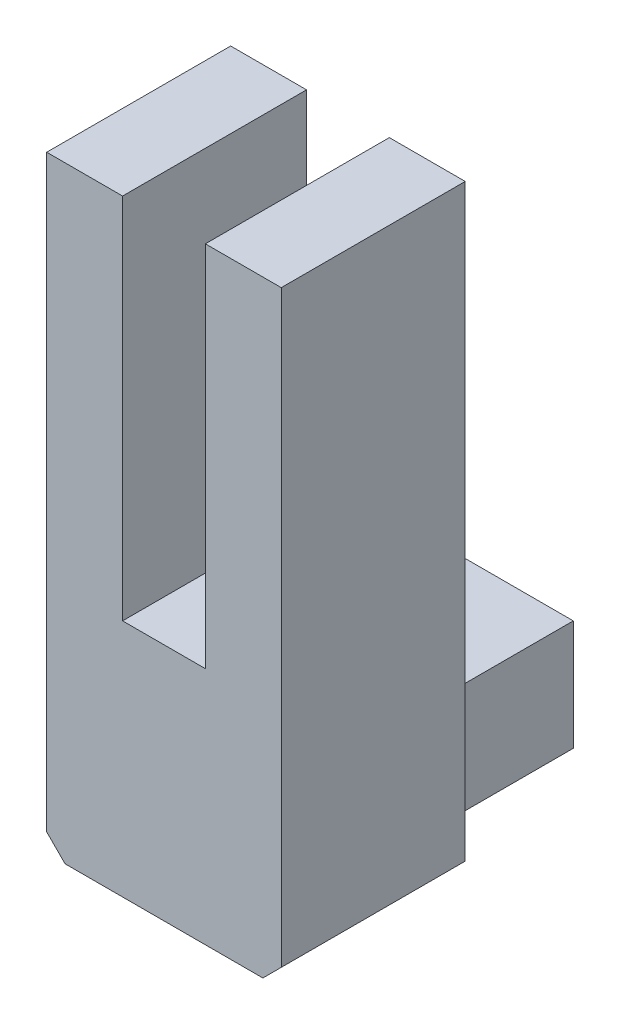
ISO-10303-21;
HEADER;
FILE_DESCRIPTION(('STEP AP214'),'2;1');
FILE_NAME('part.step','',(''),(''),'','','');
FILE_SCHEMA(('AUTOMOTIVE_DESIGN { 1 0 10303 214 1 1 1 1 }'));
ENDSEC;
DATA;
#1=APPLICATION_CONTEXT('core data for automotive mechanical design processes');
#2=APPLICATION_PROTOCOL_DEFINITION('international standard','automotive_design',2000,#1);
#3=PRODUCT_CONTEXT('',#1,'mechanical');
#4=PRODUCT('Part','Part','',(#3));
#5=PRODUCT_RELATED_PRODUCT_CATEGORY('part','',(#4));
#6=PRODUCT_DEFINITION_FORMATION('','',#4);
#7=PRODUCT_DEFINITION_CONTEXT('part definition',#1,'design');
#8=PRODUCT_DEFINITION('design','',#6,#7);
#9=PRODUCT_DEFINITION_SHAPE('','',#8);
#10=(LENGTH_UNIT() NAMED_UNIT(*) SI_UNIT(.MILLI.,.METRE.));
#11=(NAMED_UNIT(*) PLANE_ANGLE_UNIT() SI_UNIT($,.RADIAN.));
#12=(NAMED_UNIT(*) SI_UNIT($,.STERADIAN.) SOLID_ANGLE_UNIT());
#13=UNCERTAINTY_MEASURE_WITH_UNIT(LENGTH_MEASURE(1.E-05),#10,'distance_accuracy_value','');
#14=(GEOMETRIC_REPRESENTATION_CONTEXT(3) GLOBAL_UNCERTAINTY_ASSIGNED_CONTEXT((#13)) GLOBAL_UNIT_ASSIGNED_CONTEXT((#10,
#11,#12)) REPRESENTATION_CONTEXT('',''));
#15=CARTESIAN_POINT('',(0.,0.,0.));
#16=DIRECTION('',(0.,0.,1.));
#17=DIRECTION('',(1.,0.,0.));
#18=AXIS2_PLACEMENT_3D('',#15,#16,#17);
#19=CARTESIAN_POINT('',(-4.49999999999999,40.,0.));
#20=DIRECTION('',(0.,0.,1.));
#21=DIRECTION('',(1.,0.,0.));
#22=AXIS2_PLACEMENT_3D('',#19,#20,#21);
#23=PLANE('',#22);
#24=DIRECTION('',(0.,-1.,0.));
#25=VECTOR('',#24,1.);
#26=CARTESIAN_POINT('',(6.,-26.,0.));
#27=LINE('',#26,#25);
#28=CARTESIAN_POINT('',(6.,-14.,0.));
#29=VERTEX_POINT('',#28);
#30=CARTESIAN_POINT('',(6.,-26.,0.));
#31=VERTEX_POINT('',#30);
#32=EDGE_CURVE('E37',#29,#31,#27,.T.);
#33=ORIENTED_EDGE('',*,*,#32,.F.);
#34=DIRECTION('',(1.,0.,0.));
#35=VECTOR('',#34,1.);
#36=CARTESIAN_POINT('',(6.,-14.,0.));
#37=LINE('',#36,#35);
#38=CARTESIAN_POINT('',(-6.,-14.,0.));
#39=VERTEX_POINT('',#38);
#40=EDGE_CURVE('E154',#39,#29,#37,.T.);
#41=ORIENTED_EDGE('',*,*,#40,.F.);
#42=DIRECTION('',(0.,1.,0.));
#43=VECTOR('',#42,1.);
#44=CARTESIAN_POINT('',(-6.,-26.,0.));
#45=LINE('',#44,#43);
#46=CARTESIAN_POINT('',(-6.,-26.,0.));
#47=VERTEX_POINT('',#46);
#48=EDGE_CURVE('E170',#47,#39,#45,.T.);
#49=ORIENTED_EDGE('',*,*,#48,.F.);
#50=DIRECTION('',(1.,0.,0.));
#51=VECTOR('',#50,1.);
#52=CARTESIAN_POINT('',(-10.75,-26.,0.));
#53=LINE('',#52,#51);
#54=CARTESIAN_POINT('',(-10.75,-26.,0.));
#55=VERTEX_POINT('',#54);
#56=EDGE_CURVE('E175',#55,#47,#53,.T.);
#57=ORIENTED_EDGE('',*,*,#56,.F.);
#58=DIRECTION('',(0.707106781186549,-0.707106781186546,0.));
#59=VECTOR('',#58,1.);
#60=CARTESIAN_POINT('',(-12.75,-24.,0.));
#61=LINE('',#60,#59);
#62=CARTESIAN_POINT('',(-12.75,-24.,0.));
#63=VERTEX_POINT('',#62);
#64=EDGE_CURVE('E176',#63,#55,#61,.T.);
#65=ORIENTED_EDGE('',*,*,#64,.F.);
#66=DIRECTION('',(0.,-1.,0.));
#67=VECTOR('',#66,1.);
#68=CARTESIAN_POINT('',(-12.75,40.,0.));
#69=LINE('',#68,#67);
#70=CARTESIAN_POINT('',(-12.75,40.,0.));
#71=VERTEX_POINT('',#70);
#72=EDGE_CURVE('E225',#71,#63,#69,.T.);
#73=ORIENTED_EDGE('',*,*,#72,.F.);
#74=DIRECTION('',(-1.,0.,0.));
#75=VECTOR('',#74,1.);
#76=CARTESIAN_POINT('',(-4.49999999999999,40.,0.));
#77=LINE('',#76,#75);
#78=CARTESIAN_POINT('',(-4.49999999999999,40.,0.));
#79=VERTEX_POINT('',#78);
#80=EDGE_CURVE('E160',#79,#71,#77,.T.);
#81=ORIENTED_EDGE('',*,*,#80,.F.);
#82=DIRECTION('',(0.,1.,0.));
#83=VECTOR('',#82,1.);
#84=CARTESIAN_POINT('',(-4.49999999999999,0.,0.));
#85=LINE('',#84,#83);
#86=CARTESIAN_POINT('',(-4.49999999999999,0.,0.));
#87=VERTEX_POINT('',#86);
#88=EDGE_CURVE('E157',#87,#79,#85,.T.);
#89=ORIENTED_EDGE('',*,*,#88,.F.);
#90=DIRECTION('',(-1.,0.,0.));
#91=VECTOR('',#90,1.);
#92=CARTESIAN_POINT('',(4.5,0.,0.));
#93=LINE('',#92,#91);
#94=CARTESIAN_POINT('',(4.5,0.,0.));
#95=VERTEX_POINT('',#94);
#96=EDGE_CURVE('E190',#95,#87,#93,.T.);
#97=ORIENTED_EDGE('',*,*,#96,.F.);
#98=DIRECTION('',(0.,-1.,0.));
#99=VECTOR('',#98,1.);
#100=CARTESIAN_POINT('',(4.5,0.,0.));
#101=LINE('',#100,#99);
#102=CARTESIAN_POINT('',(4.49999999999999,40.,0.));
#103=VERTEX_POINT('',#102);
#104=EDGE_CURVE('E188',#103,#95,#101,.T.);
#105=ORIENTED_EDGE('',*,*,#104,.F.);
#106=DIRECTION('',(-1.,0.,0.));
#107=VECTOR('',#106,1.);
#108=CARTESIAN_POINT('',(4.49999999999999,40.,0.));
#109=LINE('',#108,#107);
#110=CARTESIAN_POINT('',(12.75,40.,0.));
#111=VERTEX_POINT('',#110);
#112=EDGE_CURVE('E186',#111,#103,#109,.T.);
#113=ORIENTED_EDGE('',*,*,#112,.F.);
#114=DIRECTION('',(0.,1.,0.));
#115=VECTOR('',#114,1.);
#116=CARTESIAN_POINT('',(12.75,40.,0.));
#117=LINE('',#116,#115);
#118=CARTESIAN_POINT('',(12.75,-24.,0.));
#119=VERTEX_POINT('',#118);
#120=EDGE_CURVE('E184',#119,#111,#117,.T.);
#121=ORIENTED_EDGE('',*,*,#120,.F.);
#122=DIRECTION('',(0.707106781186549,0.707106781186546,0.));
#123=VECTOR('',#122,1.);
#124=CARTESIAN_POINT('',(12.75,-24.,0.));
#125=LINE('',#124,#123);
#126=CARTESIAN_POINT('',(10.75,-26.,0.));
#127=VERTEX_POINT('',#126);
#128=EDGE_CURVE('E181',#127,#119,#125,.T.);
#129=ORIENTED_EDGE('',*,*,#128,.F.);
#130=EDGE_CURVE('E55',#31,#127,#53,.T.);
#131=ORIENTED_EDGE('',*,*,#130,.F.);
#132=EDGE_LOOP('',(#33,#41,#49,#57,#65,#73,#81,#89,#97,#105,#113,#121,#129,#131));
#133=FACE_BOUND('',#132,.T.);
#134=ADVANCED_FACE('F33',(#133),#23,.F.);
#135=CARTESIAN_POINT('',(-4.49999999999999,0.,20.));
#136=DIRECTION('',(-1.,0.,0.));
#137=DIRECTION('',(0.,0.,1.));
#138=AXIS2_PLACEMENT_3D('',#135,#136,#137);
#139=PLANE('',#138);
#140=ORIENTED_EDGE('',*,*,#88,.T.);
#141=DIRECTION('',(0.,0.,-1.));
#142=VECTOR('',#141,1.);
#143=CARTESIAN_POINT('',(-4.49999999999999,40.,20.));
#144=LINE('',#143,#142);
#145=CARTESIAN_POINT('',(-4.49999999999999,40.,20.));
#146=VERTEX_POINT('',#145);
#147=EDGE_CURVE('E11',#146,#79,#144,.T.);
#148=ORIENTED_EDGE('',*,*,#147,.F.);
#149=DIRECTION('',(0.,1.,0.));
#150=VECTOR('',#149,1.);
#151=CARTESIAN_POINT('',(-4.49999999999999,0.,20.));
#152=LINE('',#151,#150);
#153=CARTESIAN_POINT('',(-4.49999999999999,0.,20.));
#154=VERTEX_POINT('',#153);
#155=EDGE_CURVE('E192',#154,#146,#152,.T.);
#156=ORIENTED_EDGE('',*,*,#155,.F.);
#157=DIRECTION('',(0.,0.,-1.));
#158=VECTOR('',#157,1.);
#159=CARTESIAN_POINT('',(-4.49999999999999,0.,20.));
#160=LINE('',#159,#158);
#161=EDGE_CURVE('E193',#154,#87,#160,.T.);
#162=ORIENTED_EDGE('',*,*,#161,.T.);
#163=EDGE_LOOP('',(#140,#148,#156,#162));
#164=FACE_BOUND('',#163,.T.);
#165=ADVANCED_FACE('F35',(#164),#139,.F.);
#166=CARTESIAN_POINT('',(-4.49999999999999,40.,20.));
#167=DIRECTION('',(0.,-1.,0.));
#168=DIRECTION('',(0.,0.,-1.));
#169=AXIS2_PLACEMENT_3D('',#166,#167,#168);
#170=PLANE('',#169);
#171=ORIENTED_EDGE('',*,*,#80,.T.);
#172=DIRECTION('',(0.,0.,-1.));
#173=VECTOR('',#172,1.);
#174=CARTESIAN_POINT('',(-12.75,40.,20.));
#175=LINE('',#174,#173);
#176=CARTESIAN_POINT('',(-12.75,40.,20.));
#177=VERTEX_POINT('',#176);
#178=EDGE_CURVE('E43',#177,#71,#175,.T.);
#179=ORIENTED_EDGE('',*,*,#178,.F.);
#180=DIRECTION('',(-1.,0.,0.));
#181=VECTOR('',#180,1.);
#182=CARTESIAN_POINT('',(-4.49999999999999,40.,20.));
#183=LINE('',#182,#181);
#184=EDGE_CURVE('E247',#146,#177,#183,.T.);
#185=ORIENTED_EDGE('',*,*,#184,.F.);
#186=ORIENTED_EDGE('',*,*,#147,.T.);
#187=EDGE_LOOP('',(#171,#179,#185,#186));
#188=FACE_BOUND('',#187,.T.);
#189=ADVANCED_FACE('F273',(#188),#170,.F.);
#190=CARTESIAN_POINT('',(-12.75,40.,20.));
#191=DIRECTION('',(1.,0.,0.));
#192=DIRECTION('',(0.,1.,0.));
#193=AXIS2_PLACEMENT_3D('',#190,#191,#192);
#194=PLANE('',#193);
#195=ORIENTED_EDGE('',*,*,#72,.T.);
#196=DIRECTION('',(0.,0.,-1.));
#197=VECTOR('',#196,1.);
#198=CARTESIAN_POINT('',(-12.75,-24.,20.));
#199=LINE('',#198,#197);
#200=CARTESIAN_POINT('',(-12.75,-24.,20.));
#201=VERTEX_POINT('',#200);
#202=EDGE_CURVE('E215',#201,#63,#199,.T.);
#203=ORIENTED_EDGE('',*,*,#202,.F.);
#204=DIRECTION('',(0.,-1.,0.));
#205=VECTOR('',#204,1.);
#206=CARTESIAN_POINT('',(-12.75,40.,20.));
#207=LINE('',#206,#205);
#208=EDGE_CURVE('E226',#177,#201,#207,.T.);
#209=ORIENTED_EDGE('',*,*,#208,.F.);
#210=ORIENTED_EDGE('',*,*,#178,.T.);
#211=EDGE_LOOP('',(#195,#203,#209,#210));
#212=FACE_BOUND('',#211,.T.);
#213=ADVANCED_FACE('F223',(#212),#194,.F.);
#214=CARTESIAN_POINT('',(-12.75,-24.,20.));
#215=DIRECTION('',(0.707106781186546,0.707106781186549,0.));
#216=DIRECTION('',(-0.707106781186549,0.707106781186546,0.));
#217=AXIS2_PLACEMENT_3D('',#214,#215,#216);
#218=PLANE('',#217);
#219=ORIENTED_EDGE('',*,*,#64,.T.);
#220=DIRECTION('',(0.,0.,-1.));
#221=VECTOR('',#220,1.);
#222=CARTESIAN_POINT('',(-10.75,-26.,20.));
#223=LINE('',#222,#221);
#224=CARTESIAN_POINT('',(-10.75,-26.,20.));
#225=VERTEX_POINT('',#224);
#226=EDGE_CURVE('E212',#225,#55,#223,.T.);
#227=ORIENTED_EDGE('',*,*,#226,.F.);
#228=DIRECTION('',(0.707106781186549,-0.707106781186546,0.));
#229=VECTOR('',#228,1.);
#230=CARTESIAN_POINT('',(-12.75,-24.,20.));
#231=LINE('',#230,#229);
#232=EDGE_CURVE('E244',#201,#225,#231,.T.);
#233=ORIENTED_EDGE('',*,*,#232,.F.);
#234=ORIENTED_EDGE('',*,*,#202,.T.);
#235=EDGE_LOOP('',(#219,#227,#233,#234));
#236=FACE_BOUND('',#235,.T.);
#237=ADVANCED_FACE('F268',(#236),#218,.F.);
#238=CARTESIAN_POINT('',(-10.75,-26.,20.));
#239=DIRECTION('',(0.,1.,0.));
#240=DIRECTION('',(-1.,0.,0.));
#241=AXIS2_PLACEMENT_3D('',#238,#239,#240);
#242=PLANE('',#241);
#243=ORIENTED_EDGE('',*,*,#56,.T.);
#244=DIRECTION('',(0.,0.,1.));
#245=VECTOR('',#244,1.);
#246=CARTESIAN_POINT('',(-6.,-26.,-18.5));
#247=LINE('',#246,#245);
#248=CARTESIAN_POINT('',(-6.,-26.,-18.5));
#249=VERTEX_POINT('',#248);
#250=EDGE_CURVE('E141',#249,#47,#247,.T.);
#251=ORIENTED_EDGE('',*,*,#250,.F.);
#252=DIRECTION('',(-1.,0.,0.));
#253=VECTOR('',#252,1.);
#254=CARTESIAN_POINT('',(6.,-26.,-18.5));
#255=LINE('',#254,#253);
#256=CARTESIAN_POINT('',(6.,-26.,-18.5));
#257=VERTEX_POINT('',#256);
#258=EDGE_CURVE('E134',#257,#249,#255,.T.);
#259=ORIENTED_EDGE('',*,*,#258,.F.);
#260=DIRECTION('',(0.,0.,1.));
#261=VECTOR('',#260,1.);
#262=CARTESIAN_POINT('',(6.,-26.,-18.5));
#263=LINE('',#262,#261);
#264=EDGE_CURVE('E139',#257,#31,#263,.T.);
#265=ORIENTED_EDGE('',*,*,#264,.T.);
#266=ORIENTED_EDGE('',*,*,#130,.T.);
#267=DIRECTION('',(0.,0.,-1.));
#268=VECTOR('',#267,1.);
#269=CARTESIAN_POINT('',(10.75,-26.,20.));
#270=LINE('',#269,#268);
#271=CARTESIAN_POINT('',(10.75,-26.,20.));
#272=VERTEX_POINT('',#271);
#273=EDGE_CURVE('E209',#272,#127,#270,.T.);
#274=ORIENTED_EDGE('',*,*,#273,.F.);
#275=DIRECTION('',(1.,0.,0.));
#276=VECTOR('',#275,1.);
#277=CARTESIAN_POINT('',(-10.75,-26.,20.));
#278=LINE('',#277,#276);
#279=EDGE_CURVE('E242',#225,#272,#278,.T.);
#280=ORIENTED_EDGE('',*,*,#279,.F.);
#281=ORIENTED_EDGE('',*,*,#226,.T.);
#282=EDGE_LOOP('',(#243,#251,#259,#265,#266,#274,#280,#281));
#283=FACE_BOUND('',#282,.T.);
#284=ADVANCED_FACE('F137',(#283),#242,.F.);
#285=CARTESIAN_POINT('',(12.75,-24.,20.));
#286=DIRECTION('',(-0.707106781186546,0.707106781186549,0.));
#287=DIRECTION('',(-0.707106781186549,-0.707106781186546,0.));
#288=AXIS2_PLACEMENT_3D('',#285,#286,#287);
#289=PLANE('',#288);
#290=ORIENTED_EDGE('',*,*,#128,.T.);
#291=DIRECTION('',(0.,0.,-1.));
#292=VECTOR('',#291,1.);
#293=CARTESIAN_POINT('',(12.75,-24.,20.));
#294=LINE('',#293,#292);
#295=CARTESIAN_POINT('',(12.75,-24.,20.));
#296=VERTEX_POINT('',#295);
#297=EDGE_CURVE('E206',#296,#119,#294,.T.);
#298=ORIENTED_EDGE('',*,*,#297,.F.);
#299=DIRECTION('',(0.707106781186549,0.707106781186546,0.));
#300=VECTOR('',#299,1.);
#301=CARTESIAN_POINT('',(12.75,-24.,20.));
#302=LINE('',#301,#300);
#303=EDGE_CURVE('E240',#272,#296,#302,.T.);
#304=ORIENTED_EDGE('',*,*,#303,.F.);
#305=ORIENTED_EDGE('',*,*,#273,.T.);
#306=EDGE_LOOP('',(#290,#298,#304,#305));
#307=FACE_BOUND('',#306,.T.);
#308=ADVANCED_FACE('F298',(#307),#289,.F.);
#309=CARTESIAN_POINT('',(12.75,40.,20.));
#310=DIRECTION('',(-1.,0.,0.));
#311=DIRECTION('',(0.,-1.,0.));
#312=AXIS2_PLACEMENT_3D('',#309,#310,#311);
#313=PLANE('',#312);
#314=ORIENTED_EDGE('',*,*,#120,.T.);
#315=DIRECTION('',(0.,0.,-1.));
#316=VECTOR('',#315,1.);
#317=CARTESIAN_POINT('',(12.75,40.,20.));
#318=LINE('',#317,#316);
#319=CARTESIAN_POINT('',(12.75,40.,20.));
#320=VERTEX_POINT('',#319);
#321=EDGE_CURVE('E203',#320,#111,#318,.T.);
#322=ORIENTED_EDGE('',*,*,#321,.F.);
#323=DIRECTION('',(0.,1.,0.));
#324=VECTOR('',#323,1.);
#325=CARTESIAN_POINT('',(12.75,40.,20.));
#326=LINE('',#325,#324);
#327=EDGE_CURVE('E238',#296,#320,#326,.T.);
#328=ORIENTED_EDGE('',*,*,#327,.F.);
#329=ORIENTED_EDGE('',*,*,#297,.T.);
#330=EDGE_LOOP('',(#314,#322,#328,#329));
#331=FACE_BOUND('',#330,.T.);
#332=ADVANCED_FACE('F293',(#331),#313,.F.);
#333=CARTESIAN_POINT('',(4.49999999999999,40.,20.));
#334=DIRECTION('',(0.,-1.,0.));
#335=DIRECTION('',(0.,0.,-1.));
#336=AXIS2_PLACEMENT_3D('',#333,#334,#335);
#337=PLANE('',#336);
#338=ORIENTED_EDGE('',*,*,#112,.T.);
#339=DIRECTION('',(0.,0.,-1.));
#340=VECTOR('',#339,1.);
#341=CARTESIAN_POINT('',(4.49999999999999,40.,20.));
#342=LINE('',#341,#340);
#343=CARTESIAN_POINT('',(4.49999999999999,40.,20.));
#344=VERTEX_POINT('',#343);
#345=EDGE_CURVE('E200',#344,#103,#342,.T.);
#346=ORIENTED_EDGE('',*,*,#345,.F.);
#347=DIRECTION('',(-1.,0.,0.));
#348=VECTOR('',#347,1.);
#349=CARTESIAN_POINT('',(4.49999999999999,40.,20.));
#350=LINE('',#349,#348);
#351=EDGE_CURVE('E236',#320,#344,#350,.T.);
#352=ORIENTED_EDGE('',*,*,#351,.F.);
#353=ORIENTED_EDGE('',*,*,#321,.T.);
#354=EDGE_LOOP('',(#338,#346,#352,#353));
#355=FACE_BOUND('',#354,.T.);
#356=ADVANCED_FACE('F289',(#355),#337,.F.);
#357=CARTESIAN_POINT('',(4.5,0.,20.));
#358=DIRECTION('',(1.,0.,0.));
#359=DIRECTION('',(0.,1.,0.));
#360=AXIS2_PLACEMENT_3D('',#357,#358,#359);
#361=PLANE('',#360);
#362=ORIENTED_EDGE('',*,*,#104,.T.);
#363=DIRECTION('',(0.,0.,-1.));
#364=VECTOR('',#363,1.);
#365=CARTESIAN_POINT('',(4.5,0.,20.));
#366=LINE('',#365,#364);
#367=CARTESIAN_POINT('',(4.5,0.,20.));
#368=VERTEX_POINT('',#367);
#369=EDGE_CURVE('E196',#368,#95,#366,.T.);
#370=ORIENTED_EDGE('',*,*,#369,.F.);
#371=DIRECTION('',(0.,-1.,0.));
#372=VECTOR('',#371,1.);
#373=CARTESIAN_POINT('',(4.5,0.,20.));
#374=LINE('',#373,#372);
#375=EDGE_CURVE('E234',#344,#368,#374,.T.);
#376=ORIENTED_EDGE('',*,*,#375,.F.);
#377=ORIENTED_EDGE('',*,*,#345,.T.);
#378=EDGE_LOOP('',(#362,#370,#376,#377));
#379=FACE_BOUND('',#378,.T.);
#380=ADVANCED_FACE('F285',(#379),#361,.F.);
#381=CARTESIAN_POINT('',(4.5,0.,20.));
#382=DIRECTION('',(0.,-1.,0.));
#383=DIRECTION('',(1.,0.,0.));
#384=AXIS2_PLACEMENT_3D('',#381,#382,#383);
#385=PLANE('',#384);
#386=ORIENTED_EDGE('',*,*,#96,.T.);
#387=ORIENTED_EDGE('',*,*,#161,.F.);
#388=DIRECTION('',(-1.,0.,0.));
#389=VECTOR('',#388,1.);
#390=CARTESIAN_POINT('',(4.5,0.,20.));
#391=LINE('',#390,#389);
#392=EDGE_CURVE('E197',#368,#154,#391,.T.);
#393=ORIENTED_EDGE('',*,*,#392,.F.);
#394=ORIENTED_EDGE('',*,*,#369,.T.);
#395=EDGE_LOOP('',(#386,#387,#393,#394));
#396=FACE_BOUND('',#395,.T.);
#397=ADVANCED_FACE('F280',(#396),#385,.F.);
#398=CARTESIAN_POINT('',(-4.49999999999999,40.,20.));
#399=DIRECTION('',(0.,0.,1.));
#400=DIRECTION('',(1.,0.,0.));
#401=AXIS2_PLACEMENT_3D('',#398,#399,#400);
#402=PLANE('',#401);
#403=ORIENTED_EDGE('',*,*,#155,.T.);
#404=ORIENTED_EDGE('',*,*,#184,.T.);
#405=ORIENTED_EDGE('',*,*,#208,.T.);
#406=ORIENTED_EDGE('',*,*,#232,.T.);
#407=ORIENTED_EDGE('',*,*,#279,.T.);
#408=ORIENTED_EDGE('',*,*,#303,.T.);
#409=ORIENTED_EDGE('',*,*,#327,.T.);
#410=ORIENTED_EDGE('',*,*,#351,.T.);
#411=ORIENTED_EDGE('',*,*,#375,.T.);
#412=ORIENTED_EDGE('',*,*,#392,.T.);
#413=EDGE_LOOP('',(#403,#404,#405,#406,#407,#408,#409,#410,#411,#412));
#414=FACE_BOUND('',#413,.T.);
#415=ADVANCED_FACE('F270',(#414),#402,.T.);
#416=CARTESIAN_POINT('',(6.,-26.,-18.5));
#417=DIRECTION('',(-1.,0.,0.));
#418=DIRECTION('',(0.,0.,1.));
#419=AXIS2_PLACEMENT_3D('',#416,#417,#418);
#420=PLANE('',#419);
#421=ORIENTED_EDGE('',*,*,#32,.T.);
#422=ORIENTED_EDGE('',*,*,#264,.F.);
#423=DIRECTION('',(0.,-1.,0.));
#424=VECTOR('',#423,1.);
#425=CARTESIAN_POINT('',(6.,-26.,-18.5));
#426=LINE('',#425,#424);
#427=CARTESIAN_POINT('',(6.,-14.,-18.5));
#428=VERTEX_POINT('',#427);
#429=EDGE_CURVE('E145',#428,#257,#426,.T.);
#430=ORIENTED_EDGE('',*,*,#429,.F.);
#431=DIRECTION('',(0.,0.,1.));
#432=VECTOR('',#431,1.);
#433=CARTESIAN_POINT('',(6.,-14.,-18.5));
#434=LINE('',#433,#432);
#435=EDGE_CURVE('E253',#428,#29,#434,.T.);
#436=ORIENTED_EDGE('',*,*,#435,.T.);
#437=EDGE_LOOP('',(#421,#422,#430,#436));
#438=FACE_BOUND('',#437,.T.);
#439=ADVANCED_FACE('F156',(#438),#420,.F.);
#440=CARTESIAN_POINT('',(-6.,-26.,-18.5));
#441=DIRECTION('',(1.,0.,0.));
#442=DIRECTION('',(0.,0.,-1.));
#443=AXIS2_PLACEMENT_3D('',#440,#441,#442);
#444=PLANE('',#443);
#445=ORIENTED_EDGE('',*,*,#48,.T.);
#446=DIRECTION('',(0.,0.,1.));
#447=VECTOR('',#446,1.);
#448=CARTESIAN_POINT('',(-6.,-14.,-18.5));
#449=LINE('',#448,#447);
#450=CARTESIAN_POINT('',(-6.,-14.,-18.5));
#451=VERTEX_POINT('',#450);
#452=EDGE_CURVE('E162',#451,#39,#449,.T.);
#453=ORIENTED_EDGE('',*,*,#452,.F.);
#454=DIRECTION('',(0.,1.,0.));
#455=VECTOR('',#454,1.);
#456=CARTESIAN_POINT('',(-6.,-26.,-18.5));
#457=LINE('',#456,#455);
#458=EDGE_CURVE('E144',#249,#451,#457,.T.);
#459=ORIENTED_EDGE('',*,*,#458,.F.);
#460=ORIENTED_EDGE('',*,*,#250,.T.);
#461=EDGE_LOOP('',(#445,#453,#459,#460));
#462=FACE_BOUND('',#461,.T.);
#463=ADVANCED_FACE('F260',(#462),#444,.F.);
#464=CARTESIAN_POINT('',(6.,-14.,-18.5));
#465=DIRECTION('',(0.,-1.,0.));
#466=DIRECTION('',(0.,0.,-1.));
#467=AXIS2_PLACEMENT_3D('',#464,#465,#466);
#468=PLANE('',#467);
#469=ORIENTED_EDGE('',*,*,#40,.T.);
#470=ORIENTED_EDGE('',*,*,#435,.F.);
#471=DIRECTION('',(1.,0.,0.));
#472=VECTOR('',#471,1.);
#473=CARTESIAN_POINT('',(6.,-14.,-18.5));
#474=LINE('',#473,#472);
#475=EDGE_CURVE('E150',#451,#428,#474,.T.);
#476=ORIENTED_EDGE('',*,*,#475,.F.);
#477=ORIENTED_EDGE('',*,*,#452,.T.);
#478=EDGE_LOOP('',(#469,#470,#476,#477));
#479=FACE_BOUND('',#478,.T.);
#480=ADVANCED_FACE('F262',(#479),#468,.F.);
#481=CARTESIAN_POINT('',(6.,-14.,-18.5));
#482=DIRECTION('',(0.,0.,1.));
#483=DIRECTION('',(1.,0.,0.));
#484=AXIS2_PLACEMENT_3D('',#481,#482,#483);
#485=PLANE('',#484);
#486=ORIENTED_EDGE('',*,*,#429,.T.);
#487=ORIENTED_EDGE('',*,*,#258,.T.);
#488=ORIENTED_EDGE('',*,*,#458,.T.);
#489=ORIENTED_EDGE('',*,*,#475,.T.);
#490=EDGE_LOOP('',(#486,#487,#488,#489));
#491=FACE_BOUND('',#490,.T.);
#492=ADVANCED_FACE('F148',(#491),#485,.F.);
#493=CLOSED_SHELL('',(#134,#165,#189,#213,#237,#284,#308,#332,#356,#380,#397,#415,#439,#463,
#480,#492));
#494=MANIFOLD_SOLID_BREP('B2',#493);
#495=ADVANCED_BREP_SHAPE_REPRESENTATION('',(#18,#494),#14);
#496=SHAPE_DEFINITION_REPRESENTATION(#9,#495);
ENDSEC;
END-ISO-10303-21;
